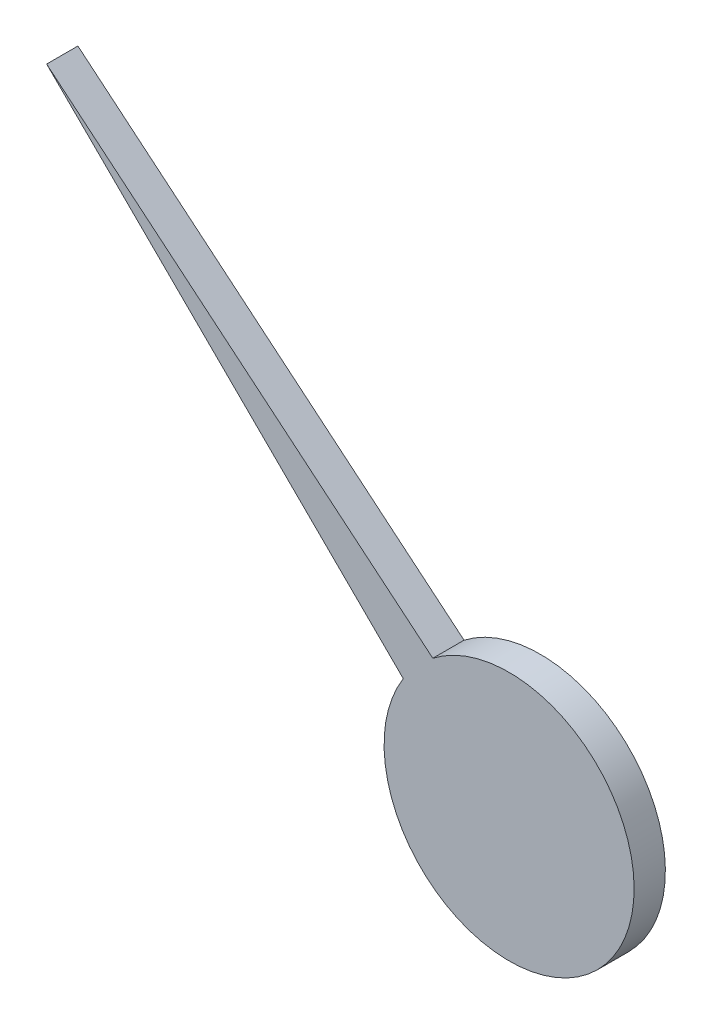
ISO-10303-21;
HEADER;
FILE_DESCRIPTION(('STEP AP214'),'2;1');
FILE_NAME('part.step','',(''),(''),'','','');
FILE_SCHEMA(('AUTOMOTIVE_DESIGN { 1 0 10303 214 1 1 1 1 }'));
ENDSEC;
DATA;
#1=APPLICATION_CONTEXT('core data for automotive mechanical design processes');
#2=APPLICATION_PROTOCOL_DEFINITION('international standard','automotive_design',2000,#1);
#3=PRODUCT_CONTEXT('',#1,'mechanical');
#4=PRODUCT('Part','Part','',(#3));
#5=PRODUCT_RELATED_PRODUCT_CATEGORY('part','',(#4));
#6=PRODUCT_DEFINITION_FORMATION('','',#4);
#7=PRODUCT_DEFINITION_CONTEXT('part definition',#1,'design');
#8=PRODUCT_DEFINITION('design','',#6,#7);
#9=PRODUCT_DEFINITION_SHAPE('','',#8);
#10=(LENGTH_UNIT() NAMED_UNIT(*) SI_UNIT(.MILLI.,.METRE.));
#11=(NAMED_UNIT(*) PLANE_ANGLE_UNIT() SI_UNIT($,.RADIAN.));
#12=(NAMED_UNIT(*) SI_UNIT($,.STERADIAN.) SOLID_ANGLE_UNIT());
#13=UNCERTAINTY_MEASURE_WITH_UNIT(LENGTH_MEASURE(1.E-05),#10,'distance_accuracy_value','');
#14=(GEOMETRIC_REPRESENTATION_CONTEXT(3) GLOBAL_UNCERTAINTY_ASSIGNED_CONTEXT((#13)) GLOBAL_UNIT_ASSIGNED_CONTEXT((#10,
#11,#12)) REPRESENTATION_CONTEXT('',''));
#15=CARTESIAN_POINT('',(0.,0.,0.));
#16=DIRECTION('',(0.,0.,1.));
#17=DIRECTION('',(1.,0.,0.));
#18=AXIS2_PLACEMENT_3D('',#15,#16,#17);
#19=CARTESIAN_POINT('',(-0.610442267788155,0.792060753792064,0.25));
#20=DIRECTION('',(-0.639857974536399,-0.768493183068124,0.));
#21=DIRECTION('',(0.768493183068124,-0.639857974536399,0.));
#22=AXIS2_PLACEMENT_3D('',#19,#20,#21);
#23=PLANE('',#22);
#24=DIRECTION('',(-0.768493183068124,0.639857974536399,0.));
#25=VECTOR('',#24,1.);
#26=CARTESIAN_POINT('',(-0.610442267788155,0.792060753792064,0.));
#27=LINE('',#26,#25);
#28=CARTESIAN_POINT('',(-0.610442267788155,0.792060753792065,0.));
#29=VERTEX_POINT('',#28);
#30=CARTESIAN_POINT('',(-3.69925767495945,3.36385086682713,0.));
#31=VERTEX_POINT('',#30);
#32=EDGE_CURVE('E79',#29,#31,#27,.T.);
#33=ORIENTED_EDGE('',*,*,#32,.T.);
#34=DIRECTION('',(0.,0.,-1.));
#35=VECTOR('',#34,1.);
#36=CARTESIAN_POINT('',(-3.69925767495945,3.36385086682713,0.25));
#37=LINE('',#36,#35);
#38=CARTESIAN_POINT('',(-3.69925767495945,3.36385086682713,0.25));
#39=VERTEX_POINT('',#38);
#40=EDGE_CURVE('E11',#39,#31,#37,.T.);
#41=ORIENTED_EDGE('',*,*,#40,.F.);
#42=DIRECTION('',(-0.768493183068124,0.639857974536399,0.));
#43=VECTOR('',#42,1.);
#44=CARTESIAN_POINT('',(-0.610442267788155,0.792060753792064,0.25));
#45=LINE('',#44,#43);
#46=CARTESIAN_POINT('',(-0.610442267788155,0.792060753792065,0.25));
#47=VERTEX_POINT('',#46);
#48=EDGE_CURVE('E72',#47,#39,#45,.T.);
#49=ORIENTED_EDGE('',*,*,#48,.F.);
#50=DIRECTION('',(0.,0.,-1.));
#51=VECTOR('',#50,1.);
#52=CARTESIAN_POINT('',(-0.610442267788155,0.792060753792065,0.25));
#53=LINE('',#52,#51);
#54=EDGE_CURVE('E80',#47,#29,#53,.T.);
#55=ORIENTED_EDGE('',*,*,#54,.T.);
#56=EDGE_LOOP('',(#33,#41,#49,#55));
#57=FACE_BOUND('',#56,.T.);
#58=ADVANCED_FACE('F32',(#57),#23,.F.);
#59=CARTESIAN_POINT('',(-3.69925767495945,3.36385086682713,0.25));
#60=DIRECTION('',(0.704401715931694,0.709801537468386,0.));
#61=DIRECTION('',(-0.709801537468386,0.704401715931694,0.));
#62=AXIS2_PLACEMENT_3D('',#59,#60,#61);
#63=PLANE('',#62);
#64=DIRECTION('',(0.709801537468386,-0.704401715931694,0.));
#65=VECTOR('',#64,1.);
#66=CARTESIAN_POINT('',(-3.69925767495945,3.36385086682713,0.));
#67=LINE('',#66,#65);
#68=CARTESIAN_POINT('',(-0.846342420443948,0.532639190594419,0.));
#69=VERTEX_POINT('',#68);
#70=EDGE_CURVE('E60',#31,#69,#67,.T.);
#71=ORIENTED_EDGE('',*,*,#70,.T.);
#72=DIRECTION('',(0.,0.,-1.));
#73=VECTOR('',#72,1.);
#74=CARTESIAN_POINT('',(-0.846342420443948,0.532639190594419,0.25));
#75=LINE('',#74,#73);
#76=CARTESIAN_POINT('',(-0.846342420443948,0.532639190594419,0.25));
#77=VERTEX_POINT('',#76);
#78=EDGE_CURVE('E40',#77,#69,#75,.T.);
#79=ORIENTED_EDGE('',*,*,#78,.F.);
#80=DIRECTION('',(0.709801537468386,-0.704401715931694,0.));
#81=VECTOR('',#80,1.);
#82=CARTESIAN_POINT('',(-3.69925767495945,3.36385086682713,0.25));
#83=LINE('',#82,#81);
#84=EDGE_CURVE('E68',#39,#77,#83,.T.);
#85=ORIENTED_EDGE('',*,*,#84,.F.);
#86=ORIENTED_EDGE('',*,*,#40,.T.);
#87=EDGE_LOOP('',(#71,#79,#85,#86));
#88=FACE_BOUND('',#87,.T.);
#89=ADVANCED_FACE('F69',(#88),#63,.F.);
#90=CARTESIAN_POINT('',(0.,0.,0.25));
#91=DIRECTION('',(0.,0.,-1.));
#92=DIRECTION('',(-1.,0.,0.));
#93=AXIS2_PLACEMENT_3D('',#90,#91,#92);
#94=CYLINDRICAL_SURFACE('',#93,0.999999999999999);
#95=CARTESIAN_POINT('',(0.,0.,0.));
#96=DIRECTION('',(0.,0.,1.));
#97=DIRECTION('',(1.,0.,0.));
#98=AXIS2_PLACEMENT_3D('',#95,#96,#97);
#99=CIRCLE('',#98,0.999999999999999);
#100=EDGE_CURVE('E65',#69,#29,#99,.T.);
#101=ORIENTED_EDGE('',*,*,#100,.T.);
#102=ORIENTED_EDGE('',*,*,#54,.F.);
#103=CARTESIAN_POINT('',(0.,0.,0.25));
#104=DIRECTION('',(0.,0.,1.));
#105=DIRECTION('',(1.,0.,0.));
#106=AXIS2_PLACEMENT_3D('',#103,#104,#105);
#107=CIRCLE('',#106,0.999999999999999);
#108=EDGE_CURVE('E48',#77,#47,#107,.T.);
#109=ORIENTED_EDGE('',*,*,#108,.F.);
#110=ORIENTED_EDGE('',*,*,#78,.T.);
#111=EDGE_LOOP('',(#101,#102,#109,#110));
#112=FACE_BOUND('',#111,.T.);
#113=ADVANCED_FACE('F87',(#112),#94,.T.);
#114=CARTESIAN_POINT('',(0.,0.,0.25));
#115=DIRECTION('',(0.,0.,1.));
#116=DIRECTION('',(1.,0.,0.));
#117=AXIS2_PLACEMENT_3D('',#114,#115,#116);
#118=PLANE('',#117);
#119=ORIENTED_EDGE('',*,*,#48,.T.);
#120=ORIENTED_EDGE('',*,*,#84,.T.);
#121=ORIENTED_EDGE('',*,*,#108,.T.);
#122=EDGE_LOOP('',(#119,#120,#121));
#123=FACE_BOUND('',#122,.T.);
#124=ADVANCED_FACE('F75',(#123),#118,.T.);
#125=CARTESIAN_POINT('',(0.,0.,0.));
#126=DIRECTION('',(0.,0.,1.));
#127=DIRECTION('',(1.,0.,0.));
#128=AXIS2_PLACEMENT_3D('',#125,#126,#127);
#129=PLANE('',#128);
#130=ORIENTED_EDGE('',*,*,#32,.F.);
#131=ORIENTED_EDGE('',*,*,#100,.F.);
#132=ORIENTED_EDGE('',*,*,#70,.F.);
#133=EDGE_LOOP('',(#130,#131,#132));
#134=FACE_BOUND('',#133,.T.);
#135=ADVANCED_FACE('F88',(#134),#129,.F.);
#136=CLOSED_SHELL('',(#58,#89,#113,#124,#135));
#137=MANIFOLD_SOLID_BREP('B2',#136);
#138=ADVANCED_BREP_SHAPE_REPRESENTATION('',(#18,#137),#14);
#139=SHAPE_DEFINITION_REPRESENTATION(#9,#138);
ENDSEC;
END-ISO-10303-21;
